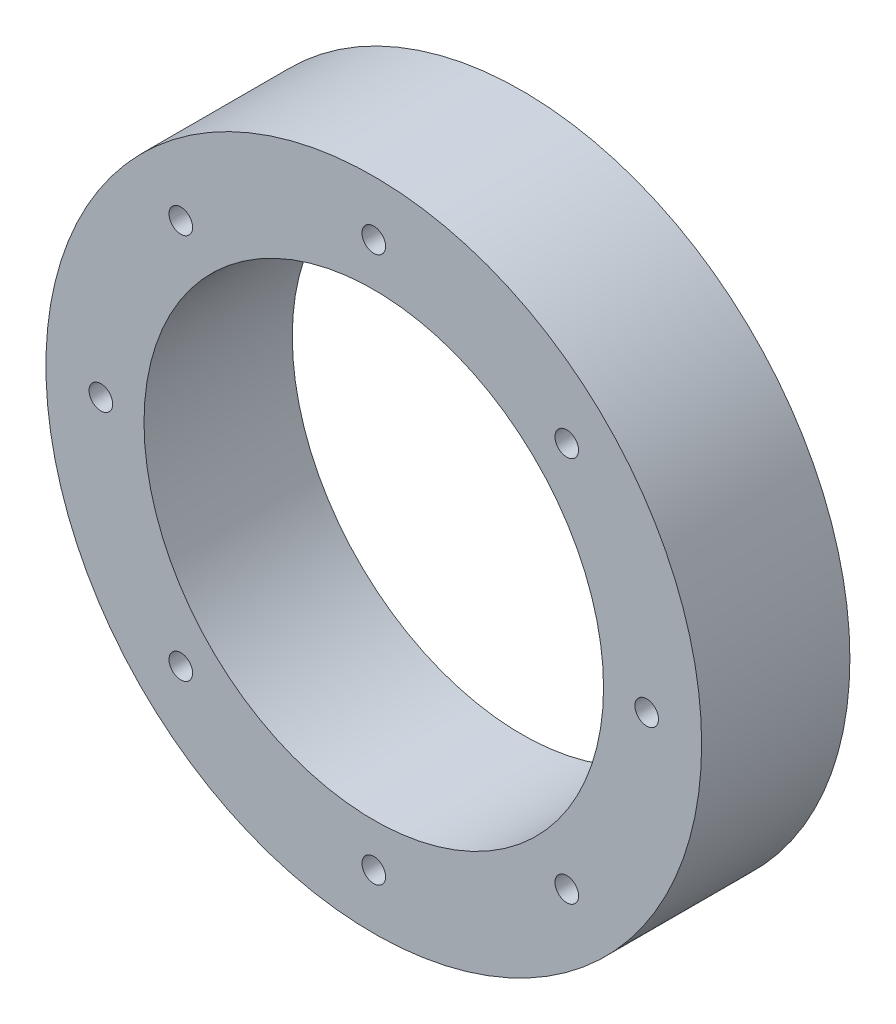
ISO-10303-21;
HEADER;
FILE_DESCRIPTION(('STEP AP214'),'2;1');
FILE_NAME('part.step','',(''),(''),'','','');
FILE_SCHEMA(('AUTOMOTIVE_DESIGN { 1 0 10303 214 1 1 1 1 }'));
ENDSEC;
DATA;
#1=APPLICATION_CONTEXT('core data for automotive mechanical design processes');
#2=APPLICATION_PROTOCOL_DEFINITION('international standard','automotive_design',2000,#1);
#3=PRODUCT_CONTEXT('',#1,'mechanical');
#4=PRODUCT('Part','Part','',(#3));
#5=PRODUCT_RELATED_PRODUCT_CATEGORY('part','',(#4));
#6=PRODUCT_DEFINITION_FORMATION('','',#4);
#7=PRODUCT_DEFINITION_CONTEXT('part definition',#1,'design');
#8=PRODUCT_DEFINITION('design','',#6,#7);
#9=PRODUCT_DEFINITION_SHAPE('','',#8);
#10=(LENGTH_UNIT() NAMED_UNIT(*) SI_UNIT(.MILLI.,.METRE.));
#11=(NAMED_UNIT(*) PLANE_ANGLE_UNIT() SI_UNIT($,.RADIAN.));
#12=(NAMED_UNIT(*) SI_UNIT($,.STERADIAN.) SOLID_ANGLE_UNIT());
#13=UNCERTAINTY_MEASURE_WITH_UNIT(LENGTH_MEASURE(1.E-05),#10,'distance_accuracy_value','');
#14=(GEOMETRIC_REPRESENTATION_CONTEXT(3) GLOBAL_UNCERTAINTY_ASSIGNED_CONTEXT((#13)) GLOBAL_UNIT_ASSIGNED_CONTEXT((#10,
#11,#12)) REPRESENTATION_CONTEXT('',''));
#15=CARTESIAN_POINT('',(0.,0.,0.));
#16=DIRECTION('',(0.,0.,1.));
#17=DIRECTION('',(1.,0.,0.));
#18=AXIS2_PLACEMENT_3D('',#15,#16,#17);
#19=CARTESIAN_POINT('',(0.,0.,10.05));
#20=DIRECTION('',(0.,0.,1.));
#21=DIRECTION('',(1.,0.,0.));
#22=AXIS2_PLACEMENT_3D('',#19,#20,#21);
#23=PLANE('',#22);
#24=CARTESIAN_POINT('',(-37.,3.87554428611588E-13,10.05));
#25=DIRECTION('',(0.,0.,1.));
#26=DIRECTION('',(1.,0.,0.));
#27=AXIS2_PLACEMENT_3D('',#24,#25,#26);
#28=CIRCLE('',#27,1.6);
#29=CARTESIAN_POINT('',(-35.4,3.87554428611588E-13,10.05));
#30=VERTEX_POINT('',#29);
#31=EDGE_CURVE('E91',#30,#30,#28,.T.);
#32=ORIENTED_EDGE('',*,*,#31,.F.);
#33=EDGE_LOOP('',(#32));
#34=FACE_BOUND('',#33,.T.);
#35=CARTESIAN_POINT('',(-2.58369619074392E-13,-37.,10.05));
#36=DIRECTION('',(0.,0.,1.));
#37=DIRECTION('',(1.,0.,0.));
#38=AXIS2_PLACEMENT_3D('',#35,#36,#37);
#39=CIRCLE('',#38,1.59999999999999);
#40=CARTESIAN_POINT('',(1.59999999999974,-37.,10.05));
#41=VERTEX_POINT('',#40);
#42=EDGE_CURVE('E83',#41,#41,#39,.T.);
#43=ORIENTED_EDGE('',*,*,#42,.F.);
#44=EDGE_LOOP('',(#43));
#45=FACE_BOUND('',#44,.T.);
#46=CARTESIAN_POINT('',(37.,-1.29184809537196E-13,10.05));
#47=DIRECTION('',(0.,0.,1.));
#48=DIRECTION('',(1.,0.,0.));
#49=AXIS2_PLACEMENT_3D('',#46,#47,#48);
#50=CIRCLE('',#49,1.6);
#51=CARTESIAN_POINT('',(38.6,-1.29184809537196E-13,10.05));
#52=VERTEX_POINT('',#51);
#53=EDGE_CURVE('E70',#52,#52,#50,.T.);
#54=ORIENTED_EDGE('',*,*,#53,.F.);
#55=EDGE_LOOP('',(#54));
#56=FACE_BOUND('',#55,.T.);
#57=CARTESIAN_POINT('',(0.,37.,10.05));
#58=DIRECTION('',(0.,0.,1.));
#59=DIRECTION('',(1.,0.,0.));
#60=AXIS2_PLACEMENT_3D('',#57,#58,#59);
#61=CIRCLE('',#60,1.6);
#62=CARTESIAN_POINT('',(1.6,37.,10.05));
#63=VERTEX_POINT('',#62);
#64=EDGE_CURVE('E60',#63,#63,#61,.T.);
#65=ORIENTED_EDGE('',*,*,#64,.F.);
#66=EDGE_LOOP('',(#65));
#67=FACE_BOUND('',#66,.T.);
#68=CARTESIAN_POINT('',(0.,0.,10.05));
#69=DIRECTION('',(0.,0.,1.));
#70=DIRECTION('',(1.,0.,0.));
#71=AXIS2_PLACEMENT_3D('',#68,#69,#70);
#72=CIRCLE('',#71,44.45);
#73=CARTESIAN_POINT('',(44.45,0.,10.05));
#74=VERTEX_POINT('',#73);
#75=EDGE_CURVE('E10',#74,#74,#72,.T.);
#76=ORIENTED_EDGE('',*,*,#75,.T.);
#77=EDGE_LOOP('',(#76));
#78=FACE_BOUND('',#77,.T.);
#79=CARTESIAN_POINT('',(0.,0.,10.05));
#80=DIRECTION('',(0.,0.,1.));
#81=DIRECTION('',(1.,0.,0.));
#82=AXIS2_PLACEMENT_3D('',#79,#80,#81);
#83=CIRCLE('',#82,31.15);
#84=CARTESIAN_POINT('',(31.15,0.,10.05));
#85=VERTEX_POINT('',#84);
#86=EDGE_CURVE('E55',#85,#85,#83,.T.);
#87=ORIENTED_EDGE('',*,*,#86,.F.);
#88=EDGE_LOOP('',(#87));
#89=FACE_BOUND('',#88,.T.);
#90=CARTESIAN_POINT('',(26.1629509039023,26.1629509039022,10.05));
#91=DIRECTION('',(0.,0.,1.));
#92=DIRECTION('',(1.,0.,0.));
#93=AXIS2_PLACEMENT_3D('',#90,#91,#92);
#94=CIRCLE('',#93,1.6);
#95=CARTESIAN_POINT('',(27.7629509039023,26.1629509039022,10.05));
#96=VERTEX_POINT('',#95);
#97=EDGE_CURVE('E64',#96,#96,#94,.T.);
#98=ORIENTED_EDGE('',*,*,#97,.F.);
#99=EDGE_LOOP('',(#98));
#100=FACE_BOUND('',#99,.T.);
#101=CARTESIAN_POINT('',(26.1629509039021,-26.1629509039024,10.05));
#102=DIRECTION('',(0.,0.,1.));
#103=DIRECTION('',(1.,0.,0.));
#104=AXIS2_PLACEMENT_3D('',#101,#102,#103);
#105=CIRCLE('',#104,1.6);
#106=CARTESIAN_POINT('',(27.7629509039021,-26.1629509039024,10.05));
#107=VERTEX_POINT('',#106);
#108=EDGE_CURVE('E73',#107,#107,#105,.T.);
#109=ORIENTED_EDGE('',*,*,#108,.F.);
#110=EDGE_LOOP('',(#109));
#111=FACE_BOUND('',#110,.T.);
#112=CARTESIAN_POINT('',(-26.1629509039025,-26.162950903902,10.05));
#113=DIRECTION('',(0.,0.,1.));
#114=DIRECTION('',(1.,0.,0.));
#115=AXIS2_PLACEMENT_3D('',#112,#113,#114);
#116=CIRCLE('',#115,1.6);
#117=CARTESIAN_POINT('',(-24.5629509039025,-26.162950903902,10.05));
#118=VERTEX_POINT('',#117);
#119=EDGE_CURVE('E87',#118,#118,#116,.T.);
#120=ORIENTED_EDGE('',*,*,#119,.F.);
#121=EDGE_LOOP('',(#120));
#122=FACE_BOUND('',#121,.T.);
#123=CARTESIAN_POINT('',(-26.1629509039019,26.1629509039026,10.05));
#124=DIRECTION('',(0.,0.,1.));
#125=DIRECTION('',(1.,0.,0.));
#126=AXIS2_PLACEMENT_3D('',#123,#124,#125);
#127=CIRCLE('',#126,1.59999999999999);
#128=CARTESIAN_POINT('',(-24.5629509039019,26.1629509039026,10.05));
#129=VERTEX_POINT('',#128);
#130=EDGE_CURVE('E97',#129,#129,#127,.T.);
#131=ORIENTED_EDGE('',*,*,#130,.F.);
#132=EDGE_LOOP('',(#131));
#133=FACE_BOUND('',#132,.T.);
#134=ADVANCED_FACE('F41',(#34,#45,#56,#67,#78,#89,#100,#111,#122,#133),#23,.T.);
#135=CARTESIAN_POINT('',(0.,0.,-10.05));
#136=DIRECTION('',(0.,0.,1.));
#137=DIRECTION('',(1.,0.,0.));
#138=AXIS2_PLACEMENT_3D('',#135,#136,#137);
#139=PLANE('',#138);
#140=CARTESIAN_POINT('',(0.,0.,-10.05));
#141=DIRECTION('',(0.,0.,1.));
#142=DIRECTION('',(1.,0.,0.));
#143=AXIS2_PLACEMENT_3D('',#140,#141,#142);
#144=CIRCLE('',#143,44.45);
#145=CARTESIAN_POINT('',(44.45,0.,-10.05));
#146=VERTEX_POINT('',#145);
#147=EDGE_CURVE('E44',#146,#146,#144,.T.);
#148=ORIENTED_EDGE('',*,*,#147,.F.);
#149=EDGE_LOOP('',(#148));
#150=FACE_BOUND('',#149,.T.);
#151=CARTESIAN_POINT('',(0.,0.,-10.05));
#152=DIRECTION('',(0.,0.,1.));
#153=DIRECTION('',(1.,0.,0.));
#154=AXIS2_PLACEMENT_3D('',#151,#152,#153);
#155=CIRCLE('',#154,31.15);
#156=CARTESIAN_POINT('',(31.15,0.,-10.05));
#157=VERTEX_POINT('',#156);
#158=EDGE_CURVE('E53',#157,#157,#155,.T.);
#159=ORIENTED_EDGE('',*,*,#158,.T.);
#160=EDGE_LOOP('',(#159));
#161=FACE_BOUND('',#160,.T.);
#162=CARTESIAN_POINT('',(0.,37.,-10.05));
#163=DIRECTION('',(0.,0.,1.));
#164=DIRECTION('',(1.,0.,0.));
#165=AXIS2_PLACEMENT_3D('',#162,#163,#164);
#166=CIRCLE('',#165,1.6);
#167=CARTESIAN_POINT('',(1.6,37.,-10.05));
#168=VERTEX_POINT('',#167);
#169=EDGE_CURVE('E58',#168,#168,#166,.T.);
#170=ORIENTED_EDGE('',*,*,#169,.T.);
#171=EDGE_LOOP('',(#170));
#172=FACE_BOUND('',#171,.T.);
#173=CARTESIAN_POINT('',(26.1629509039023,26.1629509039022,-10.05));
#174=DIRECTION('',(0.,0.,1.));
#175=DIRECTION('',(1.,0.,0.));
#176=AXIS2_PLACEMENT_3D('',#173,#174,#175);
#177=CIRCLE('',#176,1.6);
#178=CARTESIAN_POINT('',(27.7629509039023,26.1629509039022,-10.05));
#179=VERTEX_POINT('',#178);
#180=EDGE_CURVE('E68',#179,#179,#177,.T.);
#181=ORIENTED_EDGE('',*,*,#180,.T.);
#182=EDGE_LOOP('',(#181));
#183=FACE_BOUND('',#182,.T.);
#184=CARTESIAN_POINT('',(37.,-1.29184809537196E-13,-10.05));
#185=DIRECTION('',(0.,0.,1.));
#186=DIRECTION('',(1.,0.,0.));
#187=AXIS2_PLACEMENT_3D('',#184,#185,#186);
#188=CIRCLE('',#187,1.6);
#189=CARTESIAN_POINT('',(38.6,-1.29184809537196E-13,-10.05));
#190=VERTEX_POINT('',#189);
#191=EDGE_CURVE('E75',#190,#190,#188,.T.);
#192=ORIENTED_EDGE('',*,*,#191,.T.);
#193=EDGE_LOOP('',(#192));
#194=FACE_BOUND('',#193,.T.);
#195=CARTESIAN_POINT('',(26.1629509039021,-26.1629509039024,-10.05));
#196=DIRECTION('',(0.,0.,1.));
#197=DIRECTION('',(1.,0.,0.));
#198=AXIS2_PLACEMENT_3D('',#195,#196,#197);
#199=CIRCLE('',#198,1.6);
#200=CARTESIAN_POINT('',(27.7629509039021,-26.1629509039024,-10.05));
#201=VERTEX_POINT('',#200);
#202=EDGE_CURVE('E79',#201,#201,#199,.T.);
#203=ORIENTED_EDGE('',*,*,#202,.T.);
#204=EDGE_LOOP('',(#203));
#205=FACE_BOUND('',#204,.T.);
#206=CARTESIAN_POINT('',(-2.58369619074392E-13,-37.,-10.05));
#207=DIRECTION('',(0.,0.,1.));
#208=DIRECTION('',(1.,0.,0.));
#209=AXIS2_PLACEMENT_3D('',#206,#207,#208);
#210=CIRCLE('',#209,1.59999999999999);
#211=CARTESIAN_POINT('',(1.59999999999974,-37.,-10.05));
#212=VERTEX_POINT('',#211);
#213=EDGE_CURVE('E85',#212,#212,#210,.T.);
#214=ORIENTED_EDGE('',*,*,#213,.T.);
#215=EDGE_LOOP('',(#214));
#216=FACE_BOUND('',#215,.T.);
#217=CARTESIAN_POINT('',(-26.1629509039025,-26.162950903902,-10.05));
#218=DIRECTION('',(0.,0.,1.));
#219=DIRECTION('',(1.,0.,0.));
#220=AXIS2_PLACEMENT_3D('',#217,#218,#219);
#221=CIRCLE('',#220,1.6);
#222=CARTESIAN_POINT('',(-24.5629509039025,-26.162950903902,-10.05));
#223=VERTEX_POINT('',#222);
#224=EDGE_CURVE('E89',#223,#223,#221,.T.);
#225=ORIENTED_EDGE('',*,*,#224,.T.);
#226=EDGE_LOOP('',(#225));
#227=FACE_BOUND('',#226,.T.);
#228=CARTESIAN_POINT('',(-37.,3.87554428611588E-13,-10.05));
#229=DIRECTION('',(0.,0.,1.));
#230=DIRECTION('',(1.,0.,0.));
#231=AXIS2_PLACEMENT_3D('',#228,#229,#230);
#232=CIRCLE('',#231,1.6);
#233=CARTESIAN_POINT('',(-35.4,3.87554428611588E-13,-10.05));
#234=VERTEX_POINT('',#233);
#235=EDGE_CURVE('E96',#234,#234,#232,.T.);
#236=ORIENTED_EDGE('',*,*,#235,.T.);
#237=EDGE_LOOP('',(#236));
#238=FACE_BOUND('',#237,.T.);
#239=CARTESIAN_POINT('',(-26.1629509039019,26.1629509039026,-10.05));
#240=DIRECTION('',(0.,0.,1.));
#241=DIRECTION('',(1.,0.,0.));
#242=AXIS2_PLACEMENT_3D('',#239,#240,#241);
#243=CIRCLE('',#242,1.59999999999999);
#244=CARTESIAN_POINT('',(-24.5629509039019,26.1629509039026,-10.05));
#245=VERTEX_POINT('',#244);
#246=EDGE_CURVE('E105',#245,#245,#243,.T.);
#247=ORIENTED_EDGE('',*,*,#246,.T.);
#248=EDGE_LOOP('',(#247));
#249=FACE_BOUND('',#248,.T.);
#250=ADVANCED_FACE('F115',(#150,#161,#172,#183,#194,#205,#216,#227,#238,#249),#139,.F.);
#251=CARTESIAN_POINT('',(0.,0.,10.05));
#252=DIRECTION('',(0.,0.,-1.));
#253=DIRECTION('',(-1.,0.,0.));
#254=AXIS2_PLACEMENT_3D('',#251,#252,#253);
#255=CYLINDRICAL_SURFACE('',#254,44.45);
#256=ORIENTED_EDGE('',*,*,#75,.F.);
#257=EDGE_LOOP('',(#256));
#258=FACE_BOUND('',#257,.T.);
#259=ORIENTED_EDGE('',*,*,#147,.T.);
#260=EDGE_LOOP('',(#259));
#261=FACE_BOUND('',#260,.T.);
#262=ADVANCED_FACE('F43',(#258,#261),#255,.T.);
#263=CARTESIAN_POINT('',(0.,0.,10.05));
#264=DIRECTION('',(0.,0.,-1.));
#265=DIRECTION('',(-1.,0.,0.));
#266=AXIS2_PLACEMENT_3D('',#263,#264,#265);
#267=CYLINDRICAL_SURFACE('',#266,31.15);
#268=ORIENTED_EDGE('',*,*,#86,.T.);
#269=EDGE_LOOP('',(#268));
#270=FACE_BOUND('',#269,.T.);
#271=ORIENTED_EDGE('',*,*,#158,.F.);
#272=EDGE_LOOP('',(#271));
#273=FACE_BOUND('',#272,.T.);
#274=ADVANCED_FACE('F124',(#270,#273),#267,.F.);
#275=CARTESIAN_POINT('',(0.,37.,10.05));
#276=DIRECTION('',(0.,0.,-1.));
#277=DIRECTION('',(-1.,0.,0.));
#278=AXIS2_PLACEMENT_3D('',#275,#276,#277);
#279=CYLINDRICAL_SURFACE('',#278,1.6);
#280=ORIENTED_EDGE('',*,*,#64,.T.);
#281=EDGE_LOOP('',(#280));
#282=FACE_BOUND('',#281,.T.);
#283=ORIENTED_EDGE('',*,*,#169,.F.);
#284=EDGE_LOOP('',(#283));
#285=FACE_BOUND('',#284,.T.);
#286=ADVANCED_FACE('F121',(#282,#285),#279,.F.);
#287=CARTESIAN_POINT('',(26.1629509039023,26.1629509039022,10.05));
#288=DIRECTION('',(0.,0.,-1.));
#289=DIRECTION('',(-1.,0.,0.));
#290=AXIS2_PLACEMENT_3D('',#287,#288,#289);
#291=CYLINDRICAL_SURFACE('',#290,1.6);
#292=ORIENTED_EDGE('',*,*,#97,.T.);
#293=EDGE_LOOP('',(#292));
#294=FACE_BOUND('',#293,.T.);
#295=ORIENTED_EDGE('',*,*,#180,.F.);
#296=EDGE_LOOP('',(#295));
#297=FACE_BOUND('',#296,.T.);
#298=ADVANCED_FACE('F129',(#294,#297),#291,.F.);
#299=CARTESIAN_POINT('',(37.,-1.29184809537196E-13,10.05));
#300=DIRECTION('',(0.,0.,-1.));
#301=DIRECTION('',(-1.,0.,0.));
#302=AXIS2_PLACEMENT_3D('',#299,#300,#301);
#303=CYLINDRICAL_SURFACE('',#302,1.6);
#304=ORIENTED_EDGE('',*,*,#53,.T.);
#305=EDGE_LOOP('',(#304));
#306=FACE_BOUND('',#305,.T.);
#307=ORIENTED_EDGE('',*,*,#191,.F.);
#308=EDGE_LOOP('',(#307));
#309=FACE_BOUND('',#308,.T.);
#310=ADVANCED_FACE('F134',(#306,#309),#303,.F.);
#311=CARTESIAN_POINT('',(26.1629509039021,-26.1629509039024,10.05));
#312=DIRECTION('',(0.,0.,-1.));
#313=DIRECTION('',(-1.,0.,0.));
#314=AXIS2_PLACEMENT_3D('',#311,#312,#313);
#315=CYLINDRICAL_SURFACE('',#314,1.6);
#316=ORIENTED_EDGE('',*,*,#108,.T.);
#317=EDGE_LOOP('',(#316));
#318=FACE_BOUND('',#317,.T.);
#319=ORIENTED_EDGE('',*,*,#202,.F.);
#320=EDGE_LOOP('',(#319));
#321=FACE_BOUND('',#320,.T.);
#322=ADVANCED_FACE('F139',(#318,#321),#315,.F.);
#323=CARTESIAN_POINT('',(-2.58369619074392E-13,-37.,10.05));
#324=DIRECTION('',(0.,0.,-1.));
#325=DIRECTION('',(-1.,0.,0.));
#326=AXIS2_PLACEMENT_3D('',#323,#324,#325);
#327=CYLINDRICAL_SURFACE('',#326,1.59999999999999);
#328=ORIENTED_EDGE('',*,*,#42,.T.);
#329=EDGE_LOOP('',(#328));
#330=FACE_BOUND('',#329,.T.);
#331=ORIENTED_EDGE('',*,*,#213,.F.);
#332=EDGE_LOOP('',(#331));
#333=FACE_BOUND('',#332,.T.);
#334=ADVANCED_FACE('F143',(#330,#333),#327,.F.);
#335=CARTESIAN_POINT('',(-26.1629509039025,-26.162950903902,10.05));
#336=DIRECTION('',(0.,0.,-1.));
#337=DIRECTION('',(-1.,0.,0.));
#338=AXIS2_PLACEMENT_3D('',#335,#336,#337);
#339=CYLINDRICAL_SURFACE('',#338,1.6);
#340=ORIENTED_EDGE('',*,*,#119,.T.);
#341=EDGE_LOOP('',(#340));
#342=FACE_BOUND('',#341,.T.);
#343=ORIENTED_EDGE('',*,*,#224,.F.);
#344=EDGE_LOOP('',(#343));
#345=FACE_BOUND('',#344,.T.);
#346=ADVANCED_FACE('F144',(#342,#345),#339,.F.);
#347=CARTESIAN_POINT('',(-37.,3.87554428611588E-13,10.05));
#348=DIRECTION('',(0.,0.,-1.));
#349=DIRECTION('',(-1.,0.,0.));
#350=AXIS2_PLACEMENT_3D('',#347,#348,#349);
#351=CYLINDRICAL_SURFACE('',#350,1.6);
#352=ORIENTED_EDGE('',*,*,#31,.T.);
#353=EDGE_LOOP('',(#352));
#354=FACE_BOUND('',#353,.T.);
#355=ORIENTED_EDGE('',*,*,#235,.F.);
#356=EDGE_LOOP('',(#355));
#357=FACE_BOUND('',#356,.T.);
#358=ADVANCED_FACE('F149',(#354,#357),#351,.F.);
#359=CARTESIAN_POINT('',(-26.1629509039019,26.1629509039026,10.05));
#360=DIRECTION('',(0.,0.,-1.));
#361=DIRECTION('',(-1.,0.,0.));
#362=AXIS2_PLACEMENT_3D('',#359,#360,#361);
#363=CYLINDRICAL_SURFACE('',#362,1.59999999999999);
#364=ORIENTED_EDGE('',*,*,#130,.T.);
#365=EDGE_LOOP('',(#364));
#366=FACE_BOUND('',#365,.T.);
#367=ORIENTED_EDGE('',*,*,#246,.F.);
#368=EDGE_LOOP('',(#367));
#369=FACE_BOUND('',#368,.T.);
#370=ADVANCED_FACE('F107',(#366,#369),#363,.F.);
#371=CLOSED_SHELL('',(#134,#250,#262,#274,#286,#298,#310,#322,#334,#346,#358,#370));
#372=MANIFOLD_SOLID_BREP('B2',#371);
#373=ADVANCED_BREP_SHAPE_REPRESENTATION('',(#18,#372),#14);
#374=SHAPE_DEFINITION_REPRESENTATION(#9,#373);
ENDSEC;
END-ISO-10303-21;
